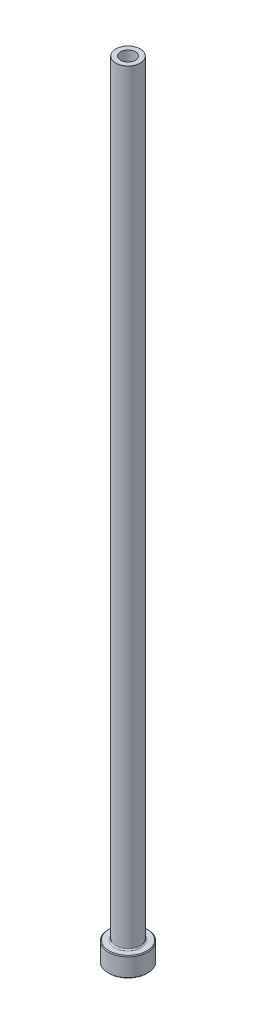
from build123d import *

# Parameters (mm, degrees)
CHAMFER1_SIZE = 0.254


with BuildPart() as part:
    # Sketch1 → Revolve1 (revolve)
    with BuildSketch(Plane.XY, mode=Mode.PRIVATE) as revolve1_sk:
        with BuildLine():
            Line((0, 0), (6.35, 0))
            Line((6.35, 0), (6.35, 6.35))
            Line((6.35, 6.35), (4.359275, 6.35))
            ThreePointArc((4.359275, 6.35), (4.078641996, 6.466241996), (3.9624, 6.746875))
            Line((3.9624, 6.746875), (3.9624, 254))
            Line((3.9624, 254), (0, 254))
            Line((0, 254), (0, 0))
        make_face()
    revolve(revolve1_sk.sketch.rotate(Axis((0, 0, 0), (0, 1, 0)), 90), axis=Axis((0, 0, 0), (0, 1, 0)))

    # Sketch2 → Cut-Revolve1 (revolve, cut)
    with BuildSketch(Plane.XY, mode=Mode.PRIVATE) as cut_revolve1_sk:
        Polygon((2.968625, 0), (2.57175, 0.396875), (2.57175, 179.5145), (2.38125, 193.802), (2.38125, 254), (0, 254), (0, 0), align=None)
    revolve(cut_revolve1_sk.sketch.rotate(Axis((0, 0, 0), (0, 1, 0)), 90), axis=Axis((0, 0, 0), (0, 1, 0)), mode=Mode.SUBTRACT)

    # Chamfer1
    chamfer1_edges = [part.edges().sort_by_distance(p)[0] for p in [
        (0, 6.35, 6.35),
        (0, 0, 6.35),
    ]]
    chamfer(chamfer1_edges, length=CHAMFER1_SIZE)


solid = part.part
